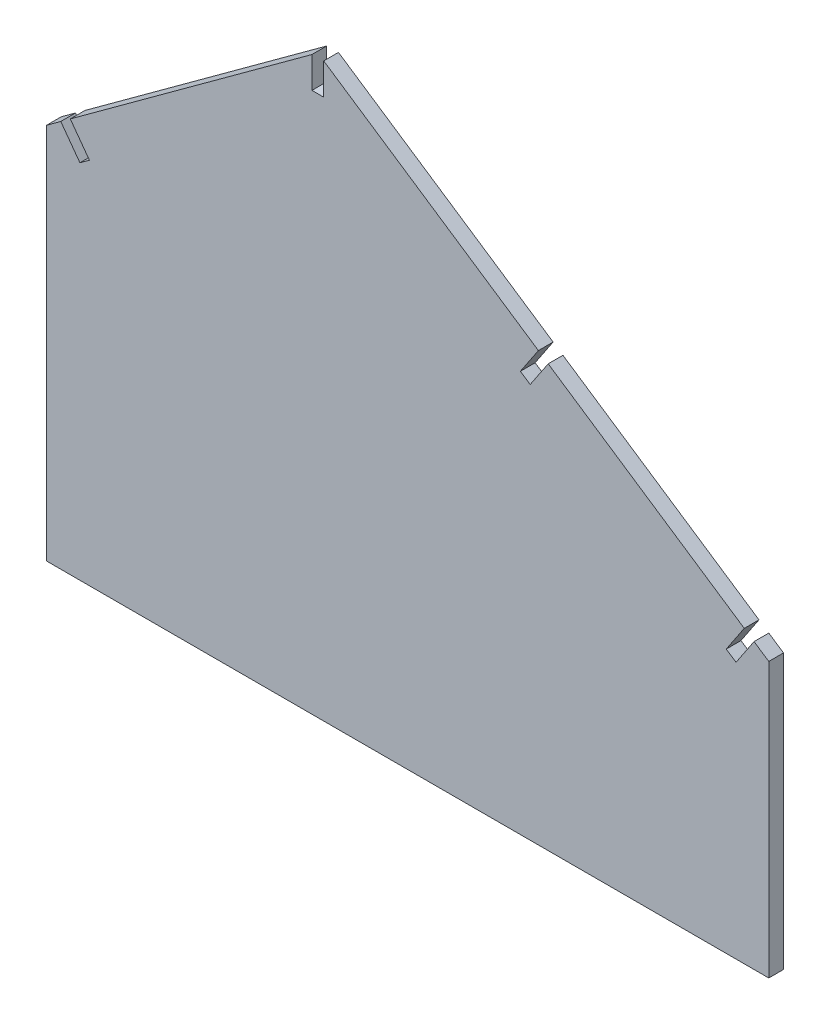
ISO-10303-21;
HEADER;
FILE_DESCRIPTION(('STEP AP214'),'2;1');
FILE_NAME('part.step','',(''),(''),'','','');
FILE_SCHEMA(('AUTOMOTIVE_DESIGN { 1 0 10303 214 1 1 1 1 }'));
ENDSEC;
DATA;
#1=APPLICATION_CONTEXT('core data for automotive mechanical design processes');
#2=APPLICATION_PROTOCOL_DEFINITION('international standard','automotive_design',2000,#1);
#3=PRODUCT_CONTEXT('',#1,'mechanical');
#4=PRODUCT('Part','Part','',(#3));
#5=PRODUCT_RELATED_PRODUCT_CATEGORY('part','',(#4));
#6=PRODUCT_DEFINITION_FORMATION('','',#4);
#7=PRODUCT_DEFINITION_CONTEXT('part definition',#1,'design');
#8=PRODUCT_DEFINITION('design','',#6,#7);
#9=PRODUCT_DEFINITION_SHAPE('','',#8);
#10=(LENGTH_UNIT() NAMED_UNIT(*) SI_UNIT(.MILLI.,.METRE.));
#11=(NAMED_UNIT(*) PLANE_ANGLE_UNIT() SI_UNIT($,.RADIAN.));
#12=(NAMED_UNIT(*) SI_UNIT($,.STERADIAN.) SOLID_ANGLE_UNIT());
#13=UNCERTAINTY_MEASURE_WITH_UNIT(LENGTH_MEASURE(1.E-05),#10,'distance_accuracy_value','');
#14=(GEOMETRIC_REPRESENTATION_CONTEXT(3) GLOBAL_UNCERTAINTY_ASSIGNED_CONTEXT((#13)) GLOBAL_UNIT_ASSIGNED_CONTEXT((#10,
#11,#12)) REPRESENTATION_CONTEXT('',''));
#15=CARTESIAN_POINT('',(0.,0.,0.));
#16=DIRECTION('',(0.,0.,1.));
#17=DIRECTION('',(1.,0.,0.));
#18=AXIS2_PLACEMENT_3D('',#15,#16,#17);
#19=CARTESIAN_POINT('',(-92.0382591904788,55.1138178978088,5.));
#20=DIRECTION('',(1.,0.,0.));
#21=DIRECTION('',(0.,1.,0.));
#22=AXIS2_PLACEMENT_3D('',#19,#20,#21);
#23=PLANE('',#22);
#24=DIRECTION('',(0.,-1.,0.));
#25=VECTOR('',#24,1.);
#26=CARTESIAN_POINT('',(-92.0382591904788,55.1138178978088,0.));
#27=LINE('',#26,#25);
#28=CARTESIAN_POINT('',(-92.0382591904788,55.1138178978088,0.));
#29=VERTEX_POINT('',#28);
#30=CARTESIAN_POINT('',(-92.0382591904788,-72.8861821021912,0.));
#31=VERTEX_POINT('',#30);
#32=EDGE_CURVE('E166',#29,#31,#27,.T.);
#33=ORIENTED_EDGE('',*,*,#32,.T.);
#34=DIRECTION('',(0.,0.,-1.));
#35=VECTOR('',#34,1.);
#36=CARTESIAN_POINT('',(-92.0382591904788,-72.8861821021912,5.));
#37=LINE('',#36,#35);
#38=CARTESIAN_POINT('',(-92.0382591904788,-72.8861821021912,5.));
#39=VERTEX_POINT('',#38);
#40=EDGE_CURVE('E11',#39,#31,#37,.T.);
#41=ORIENTED_EDGE('',*,*,#40,.F.);
#42=DIRECTION('',(0.,-1.,0.));
#43=VECTOR('',#42,1.);
#44=CARTESIAN_POINT('',(-92.0382591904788,55.1138178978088,5.));
#45=LINE('',#44,#43);
#46=CARTESIAN_POINT('',(-92.0382591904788,55.1138178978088,5.));
#47=VERTEX_POINT('',#46);
#48=EDGE_CURVE('E217',#47,#39,#45,.T.);
#49=ORIENTED_EDGE('',*,*,#48,.F.);
#50=DIRECTION('',(0.,0.,-1.));
#51=VECTOR('',#50,1.);
#52=CARTESIAN_POINT('',(-92.0382591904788,55.1138178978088,5.));
#53=LINE('',#52,#51);
#54=EDGE_CURVE('E179',#47,#29,#53,.T.);
#55=ORIENTED_EDGE('',*,*,#54,.T.);
#56=EDGE_LOOP('',(#33,#41,#49,#55));
#57=FACE_BOUND('',#56,.T.);
#58=ADVANCED_FACE('F26',(#57),#23,.F.);
#59=CARTESIAN_POINT('',(-92.0382591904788,-72.8861821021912,5.));
#60=DIRECTION('',(0.,1.,0.));
#61=DIRECTION('',(-1.,0.,0.));
#62=AXIS2_PLACEMENT_3D('',#59,#60,#61);
#63=PLANE('',#62);
#64=DIRECTION('',(1.,0.,0.));
#65=VECTOR('',#64,1.);
#66=CARTESIAN_POINT('',(-92.0382591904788,-72.8861821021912,0.));
#67=LINE('',#66,#65);
#68=CARTESIAN_POINT('',(152.961740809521,-72.8861821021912,0.));
#69=VERTEX_POINT('',#68);
#70=EDGE_CURVE('E162',#31,#69,#67,.T.);
#71=ORIENTED_EDGE('',*,*,#70,.T.);
#72=DIRECTION('',(0.,0.,-1.));
#73=VECTOR('',#72,1.);
#74=CARTESIAN_POINT('',(152.961740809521,-72.8861821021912,5.));
#75=LINE('',#74,#73);
#76=CARTESIAN_POINT('',(152.961740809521,-72.8861821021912,5.));
#77=VERTEX_POINT('',#76);
#78=EDGE_CURVE('E33',#77,#69,#75,.T.);
#79=ORIENTED_EDGE('',*,*,#78,.F.);
#80=DIRECTION('',(1.,0.,0.));
#81=VECTOR('',#80,1.);
#82=CARTESIAN_POINT('',(-92.0382591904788,-72.8861821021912,5.));
#83=LINE('',#82,#81);
#84=EDGE_CURVE('E175',#39,#77,#83,.T.);
#85=ORIENTED_EDGE('',*,*,#84,.F.);
#86=ORIENTED_EDGE('',*,*,#40,.T.);
#87=EDGE_LOOP('',(#71,#79,#85,#86));
#88=FACE_BOUND('',#87,.T.);
#89=ADVANCED_FACE('F174',(#88),#63,.F.);
#90=CARTESIAN_POINT('',(152.961740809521,-72.8861821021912,5.));
#91=DIRECTION('',(-1.,0.,0.));
#92=DIRECTION('',(0.,0.,1.));
#93=AXIS2_PLACEMENT_3D('',#90,#91,#92);
#94=PLANE('',#93);
#95=DIRECTION('',(0.,1.,0.));
#96=VECTOR('',#95,1.);
#97=CARTESIAN_POINT('',(152.961740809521,-72.8861821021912,0.));
#98=LINE('',#97,#96);
#99=CARTESIAN_POINT('',(152.961740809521,20.1138178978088,0.));
#100=VERTEX_POINT('',#99);
#101=EDGE_CURVE('E168',#69,#100,#98,.T.);
#102=ORIENTED_EDGE('',*,*,#101,.T.);
#103=DIRECTION('',(0.,0.,-1.));
#104=VECTOR('',#103,1.);
#105=CARTESIAN_POINT('',(152.961740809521,20.1138178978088,5.));
#106=LINE('',#105,#104);
#107=CARTESIAN_POINT('',(152.961740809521,20.1138178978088,5.));
#108=VERTEX_POINT('',#107);
#109=EDGE_CURVE('E303',#108,#100,#106,.T.);
#110=ORIENTED_EDGE('',*,*,#109,.F.);
#111=DIRECTION('',(0.,1.,0.));
#112=VECTOR('',#111,1.);
#113=CARTESIAN_POINT('',(152.961740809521,-72.8861821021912,5.));
#114=LINE('',#113,#112);
#115=EDGE_CURVE('E220',#77,#108,#114,.T.);
#116=ORIENTED_EDGE('',*,*,#115,.F.);
#117=ORIENTED_EDGE('',*,*,#78,.T.);
#118=EDGE_LOOP('',(#102,#110,#116,#117));
#119=FACE_BOUND('',#118,.T.);
#120=ADVANCED_FACE('F307',(#119),#94,.F.);
#121=CARTESIAN_POINT('',(152.961740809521,20.1138178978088,5.));
#122=DIRECTION('',(-0.555803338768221,-0.831313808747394,0.));
#123=DIRECTION('',(0.831313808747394,-0.555803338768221,0.));
#124=AXIS2_PLACEMENT_3D('',#121,#122,#123);
#125=PLANE('',#124);
#126=DIRECTION('',(-0.831313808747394,0.555803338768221,0.));
#127=VECTOR('',#126,1.);
#128=CARTESIAN_POINT('',(152.961740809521,20.1138178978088,0.));
#129=LINE('',#128,#127);
#130=CARTESIAN_POINT('',(147.973857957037,23.4486379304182,0.));
#131=VERTEX_POINT('',#130);
#132=EDGE_CURVE('E183',#100,#131,#129,.T.);
#133=ORIENTED_EDGE('',*,*,#132,.T.);
#134=DIRECTION('',(0.,0.,-1.));
#135=VECTOR('',#134,1.);
#136=CARTESIAN_POINT('',(147.973857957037,23.4486379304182,5.));
#137=LINE('',#136,#135);
#138=CARTESIAN_POINT('',(147.973857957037,23.4486379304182,5.));
#139=VERTEX_POINT('',#138);
#140=EDGE_CURVE('E300',#139,#131,#137,.T.);
#141=ORIENTED_EDGE('',*,*,#140,.F.);
#142=DIRECTION('',(-0.831313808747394,0.555803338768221,0.));
#143=VECTOR('',#142,1.);
#144=CARTESIAN_POINT('',(152.961740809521,20.1138178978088,5.));
#145=LINE('',#144,#143);
#146=EDGE_CURVE('E222',#108,#139,#145,.T.);
#147=ORIENTED_EDGE('',*,*,#146,.F.);
#148=ORIENTED_EDGE('',*,*,#109,.T.);
#149=EDGE_LOOP('',(#133,#141,#147,#148));
#150=FACE_BOUND('',#149,.T.);
#151=ADVANCED_FACE('F315',(#150),#125,.F.);
#152=CARTESIAN_POINT('',(147.973857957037,23.4486379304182,5.));
#153=DIRECTION('',(0.831313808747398,-0.555803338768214,0.));
#154=DIRECTION('',(0.555803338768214,0.831313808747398,0.));
#155=AXIS2_PLACEMENT_3D('',#152,#153,#154);
#156=PLANE('',#155);
#157=DIRECTION('',(-0.555803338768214,-0.831313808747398,0.));
#158=VECTOR('',#157,1.);
#159=CARTESIAN_POINT('',(147.973857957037,23.4486379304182,0.));
#160=LINE('',#159,#158);
#161=CARTESIAN_POINT('',(141.860021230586,14.3041860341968,0.));
#162=VERTEX_POINT('',#161);
#163=EDGE_CURVE('E185',#131,#162,#160,.T.);
#164=ORIENTED_EDGE('',*,*,#163,.T.);
#165=DIRECTION('',(0.,0.,-1.));
#166=VECTOR('',#165,1.);
#167=CARTESIAN_POINT('',(141.860021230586,14.3041860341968,5.));
#168=LINE('',#167,#166);
#169=CARTESIAN_POINT('',(141.860021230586,14.3041860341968,5.));
#170=VERTEX_POINT('',#169);
#171=EDGE_CURVE('E297',#170,#162,#168,.T.);
#172=ORIENTED_EDGE('',*,*,#171,.F.);
#173=DIRECTION('',(-0.555803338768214,-0.831313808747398,0.));
#174=VECTOR('',#173,1.);
#175=CARTESIAN_POINT('',(147.973857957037,23.4486379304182,5.));
#176=LINE('',#175,#174);
#177=EDGE_CURVE('E224',#139,#170,#176,.T.);
#178=ORIENTED_EDGE('',*,*,#177,.F.);
#179=ORIENTED_EDGE('',*,*,#140,.T.);
#180=EDGE_LOOP('',(#164,#172,#178,#179));
#181=FACE_BOUND('',#180,.T.);
#182=ADVANCED_FACE('F318',(#181),#156,.F.);
#183=CARTESIAN_POINT('',(138.534765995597,16.5273993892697,5.));
#184=DIRECTION('',(-0.555803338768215,-0.831313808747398,0.));
#185=DIRECTION('',(0.831313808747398,-0.555803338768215,0.));
#186=AXIS2_PLACEMENT_3D('',#183,#184,#185);
#187=PLANE('',#186);
#188=DIRECTION('',(-0.831313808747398,0.555803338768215,0.));
#189=VECTOR('',#188,1.);
#190=CARTESIAN_POINT('',(138.534765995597,16.5273993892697,0.));
#191=LINE('',#190,#189);
#192=CARTESIAN_POINT('',(138.534765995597,16.5273993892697,0.));
#193=VERTEX_POINT('',#192);
#194=EDGE_CURVE('E187',#162,#193,#191,.T.);
#195=ORIENTED_EDGE('',*,*,#194,.T.);
#196=DIRECTION('',(0.,0.,-1.));
#197=VECTOR('',#196,1.);
#198=CARTESIAN_POINT('',(138.534765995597,16.5273993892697,5.));
#199=LINE('',#198,#197);
#200=CARTESIAN_POINT('',(138.534765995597,16.5273993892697,5.));
#201=VERTEX_POINT('',#200);
#202=EDGE_CURVE('E294',#201,#193,#199,.T.);
#203=ORIENTED_EDGE('',*,*,#202,.F.);
#204=DIRECTION('',(-0.831313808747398,0.555803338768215,0.));
#205=VECTOR('',#204,1.);
#206=CARTESIAN_POINT('',(138.534765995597,16.5273993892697,5.));
#207=LINE('',#206,#205);
#208=EDGE_CURVE('E226',#170,#201,#207,.T.);
#209=ORIENTED_EDGE('',*,*,#208,.F.);
#210=ORIENTED_EDGE('',*,*,#171,.T.);
#211=EDGE_LOOP('',(#195,#203,#209,#210));
#212=FACE_BOUND('',#211,.T.);
#213=ADVANCED_FACE('F323',(#212),#187,.F.);
#214=CARTESIAN_POINT('',(138.534765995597,16.5273993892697,5.));
#215=DIRECTION('',(-0.831313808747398,0.555803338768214,0.));
#216=DIRECTION('',(-0.555803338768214,-0.831313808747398,0.));
#217=AXIS2_PLACEMENT_3D('',#214,#215,#216);
#218=PLANE('',#217);
#219=DIRECTION('',(0.555803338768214,0.831313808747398,0.));
#220=VECTOR('',#219,1.);
#221=CARTESIAN_POINT('',(138.534765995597,16.5273993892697,0.));
#222=LINE('',#221,#220);
#223=CARTESIAN_POINT('',(144.648602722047,25.671851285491,0.));
#224=VERTEX_POINT('',#223);
#225=EDGE_CURVE('E189',#193,#224,#222,.T.);
#226=ORIENTED_EDGE('',*,*,#225,.T.);
#227=DIRECTION('',(0.,0.,-1.));
#228=VECTOR('',#227,1.);
#229=CARTESIAN_POINT('',(144.648602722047,25.671851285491,5.));
#230=LINE('',#229,#228);
#231=CARTESIAN_POINT('',(144.648602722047,25.671851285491,5.));
#232=VERTEX_POINT('',#231);
#233=EDGE_CURVE('E291',#232,#224,#230,.T.);
#234=ORIENTED_EDGE('',*,*,#233,.F.);
#235=DIRECTION('',(0.555803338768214,0.831313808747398,0.));
#236=VECTOR('',#235,1.);
#237=CARTESIAN_POINT('',(138.534765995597,16.5273993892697,5.));
#238=LINE('',#237,#236);
#239=EDGE_CURVE('E228',#201,#232,#238,.T.);
#240=ORIENTED_EDGE('',*,*,#239,.F.);
#241=ORIENTED_EDGE('',*,*,#202,.T.);
#242=EDGE_LOOP('',(#226,#234,#240,#241));
#243=FACE_BOUND('',#242,.T.);
#244=ADVANCED_FACE('F329',(#243),#218,.F.);
#245=CARTESIAN_POINT('',(144.648602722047,25.671851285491,5.));
#246=DIRECTION('',(-0.555803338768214,-0.831313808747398,0.));
#247=DIRECTION('',(0.831313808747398,-0.555803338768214,0.));
#248=AXIS2_PLACEMENT_3D('',#245,#246,#247);
#249=PLANE('',#248);
#250=DIRECTION('',(-0.831313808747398,0.555803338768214,0.));
#251=VECTOR('',#250,1.);
#252=CARTESIAN_POINT('',(144.648602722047,25.671851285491,0.));
#253=LINE('',#252,#251);
#254=CARTESIAN_POINT('',(78.1434980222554,70.1361183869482,0.));
#255=VERTEX_POINT('',#254);
#256=EDGE_CURVE('E191',#224,#255,#253,.T.);
#257=ORIENTED_EDGE('',*,*,#256,.T.);
#258=DIRECTION('',(0.,0.,-1.));
#259=VECTOR('',#258,1.);
#260=CARTESIAN_POINT('',(78.1434980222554,70.1361183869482,5.));
#261=LINE('',#260,#259);
#262=CARTESIAN_POINT('',(78.1434980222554,70.1361183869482,5.));
#263=VERTEX_POINT('',#262);
#264=EDGE_CURVE('E288',#263,#255,#261,.T.);
#265=ORIENTED_EDGE('',*,*,#264,.F.);
#266=DIRECTION('',(-0.831313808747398,0.555803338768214,0.));
#267=VECTOR('',#266,1.);
#268=CARTESIAN_POINT('',(144.648602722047,25.671851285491,5.));
#269=LINE('',#268,#267);
#270=EDGE_CURVE('E230',#232,#263,#269,.T.);
#271=ORIENTED_EDGE('',*,*,#270,.F.);
#272=ORIENTED_EDGE('',*,*,#233,.T.);
#273=EDGE_LOOP('',(#257,#265,#271,#272));
#274=FACE_BOUND('',#273,.T.);
#275=ADVANCED_FACE('F333',(#274),#249,.F.);
#276=CARTESIAN_POINT('',(78.1434980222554,70.1361183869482,5.));
#277=DIRECTION('',(0.831313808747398,-0.555803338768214,0.));
#278=DIRECTION('',(0.555803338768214,0.831313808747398,0.));
#279=AXIS2_PLACEMENT_3D('',#276,#277,#278);
#280=PLANE('',#279);
#281=DIRECTION('',(-0.555803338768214,-0.831313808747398,0.));
#282=VECTOR('',#281,1.);
#283=CARTESIAN_POINT('',(78.1434980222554,70.1361183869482,0.));
#284=LINE('',#283,#282);
#285=CARTESIAN_POINT('',(72.0296612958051,60.9916664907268,0.));
#286=VERTEX_POINT('',#285);
#287=EDGE_CURVE('E193',#255,#286,#284,.T.);
#288=ORIENTED_EDGE('',*,*,#287,.T.);
#289=DIRECTION('',(0.,0.,-1.));
#290=VECTOR('',#289,1.);
#291=CARTESIAN_POINT('',(72.0296612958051,60.9916664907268,5.));
#292=LINE('',#291,#290);
#293=CARTESIAN_POINT('',(72.0296612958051,60.9916664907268,5.));
#294=VERTEX_POINT('',#293);
#295=EDGE_CURVE('E285',#294,#286,#292,.T.);
#296=ORIENTED_EDGE('',*,*,#295,.F.);
#297=DIRECTION('',(-0.555803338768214,-0.831313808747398,0.));
#298=VECTOR('',#297,1.);
#299=CARTESIAN_POINT('',(78.1434980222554,70.1361183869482,5.));
#300=LINE('',#299,#298);
#301=EDGE_CURVE('E232',#263,#294,#300,.T.);
#302=ORIENTED_EDGE('',*,*,#301,.F.);
#303=ORIENTED_EDGE('',*,*,#264,.T.);
#304=EDGE_LOOP('',(#288,#296,#302,#303));
#305=FACE_BOUND('',#304,.T.);
#306=ADVANCED_FACE('F338',(#305),#280,.F.);
#307=CARTESIAN_POINT('',(68.7044060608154,63.2148798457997,5.));
#308=DIRECTION('',(-0.555803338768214,-0.831313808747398,0.));
#309=DIRECTION('',(0.831313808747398,-0.555803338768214,0.));
#310=AXIS2_PLACEMENT_3D('',#307,#308,#309);
#311=PLANE('',#310);
#312=DIRECTION('',(-0.831313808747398,0.555803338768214,0.));
#313=VECTOR('',#312,1.);
#314=CARTESIAN_POINT('',(68.7044060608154,63.2148798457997,0.));
#315=LINE('',#314,#313);
#316=CARTESIAN_POINT('',(68.7044060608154,63.2148798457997,0.));
#317=VERTEX_POINT('',#316);
#318=EDGE_CURVE('E195',#286,#317,#315,.T.);
#319=ORIENTED_EDGE('',*,*,#318,.T.);
#320=DIRECTION('',(0.,0.,-1.));
#321=VECTOR('',#320,1.);
#322=CARTESIAN_POINT('',(68.7044060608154,63.2148798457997,5.));
#323=LINE('',#322,#321);
#324=CARTESIAN_POINT('',(68.7044060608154,63.2148798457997,5.));
#325=VERTEX_POINT('',#324);
#326=EDGE_CURVE('E282',#325,#317,#323,.T.);
#327=ORIENTED_EDGE('',*,*,#326,.F.);
#328=DIRECTION('',(-0.831313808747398,0.555803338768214,0.));
#329=VECTOR('',#328,1.);
#330=CARTESIAN_POINT('',(68.7044060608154,63.2148798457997,5.));
#331=LINE('',#330,#329);
#332=EDGE_CURVE('E234',#294,#325,#331,.T.);
#333=ORIENTED_EDGE('',*,*,#332,.F.);
#334=ORIENTED_EDGE('',*,*,#295,.T.);
#335=EDGE_LOOP('',(#319,#327,#333,#334));
#336=FACE_BOUND('',#335,.T.);
#337=ADVANCED_FACE('F344',(#336),#311,.F.);
#338=CARTESIAN_POINT('',(68.7044060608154,63.2148798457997,5.));
#339=DIRECTION('',(-0.831313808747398,0.555803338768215,0.));
#340=DIRECTION('',(-0.555803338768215,-0.831313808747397,0.));
#341=AXIS2_PLACEMENT_3D('',#338,#339,#340);
#342=PLANE('',#341);
#343=DIRECTION('',(0.555803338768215,0.831313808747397,0.));
#344=VECTOR('',#343,1.);
#345=CARTESIAN_POINT('',(68.7044060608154,63.2148798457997,0.));
#346=LINE('',#345,#344);
#347=CARTESIAN_POINT('',(74.8182427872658,72.359331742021,0.));
#348=VERTEX_POINT('',#347);
#349=EDGE_CURVE('E197',#317,#348,#346,.T.);
#350=ORIENTED_EDGE('',*,*,#349,.T.);
#351=DIRECTION('',(0.,0.,-1.));
#352=VECTOR('',#351,1.);
#353=CARTESIAN_POINT('',(74.8182427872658,72.359331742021,5.));
#354=LINE('',#353,#352);
#355=CARTESIAN_POINT('',(74.8182427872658,72.359331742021,5.));
#356=VERTEX_POINT('',#355);
#357=EDGE_CURVE('E279',#356,#348,#354,.T.);
#358=ORIENTED_EDGE('',*,*,#357,.F.);
#359=DIRECTION('',(0.555803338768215,0.831313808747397,0.));
#360=VECTOR('',#359,1.);
#361=CARTESIAN_POINT('',(68.7044060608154,63.2148798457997,5.));
#362=LINE('',#361,#360);
#363=EDGE_CURVE('E236',#325,#356,#362,.T.);
#364=ORIENTED_EDGE('',*,*,#363,.F.);
#365=ORIENTED_EDGE('',*,*,#326,.T.);
#366=EDGE_LOOP('',(#350,#358,#364,#365));
#367=FACE_BOUND('',#366,.T.);
#368=ADVANCED_FACE('F348',(#367),#342,.F.);
#369=CARTESIAN_POINT('',(74.8182427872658,72.359331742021,5.));
#370=DIRECTION('',(-0.555803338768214,-0.831313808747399,0.));
#371=DIRECTION('',(0.831313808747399,-0.555803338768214,0.));
#372=AXIS2_PLACEMENT_3D('',#369,#370,#371);
#373=PLANE('',#372);
#374=DIRECTION('',(-0.831313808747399,0.555803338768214,0.));
#375=VECTOR('',#374,1.);
#376=CARTESIAN_POINT('',(74.8182427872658,72.359331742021,0.));
#377=LINE('',#376,#375);
#378=CARTESIAN_POINT('',(2.,121.04446368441,0.));
#379=VERTEX_POINT('',#378);
#380=EDGE_CURVE('E199',#348,#379,#377,.T.);
#381=ORIENTED_EDGE('',*,*,#380,.T.);
#382=DIRECTION('',(0.,0.,-1.));
#383=VECTOR('',#382,1.);
#384=CARTESIAN_POINT('',(2.,121.04446368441,5.));
#385=LINE('',#384,#383);
#386=CARTESIAN_POINT('',(2.,121.04446368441,5.));
#387=VERTEX_POINT('',#386);
#388=EDGE_CURVE('E276',#387,#379,#385,.T.);
#389=ORIENTED_EDGE('',*,*,#388,.F.);
#390=DIRECTION('',(-0.831313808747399,0.555803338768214,0.));
#391=VECTOR('',#390,1.);
#392=CARTESIAN_POINT('',(74.8182427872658,72.359331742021,5.));
#393=LINE('',#392,#391);
#394=EDGE_CURVE('E238',#356,#387,#393,.T.);
#395=ORIENTED_EDGE('',*,*,#394,.F.);
#396=ORIENTED_EDGE('',*,*,#357,.T.);
#397=EDGE_LOOP('',(#381,#389,#395,#396));
#398=FACE_BOUND('',#397,.T.);
#399=ADVANCED_FACE('F353',(#398),#373,.F.);
#400=CARTESIAN_POINT('',(1.99999999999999,110.38163223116,5.));
#401=DIRECTION('',(1.,0.,0.));
#402=DIRECTION('',(0.,1.,0.));
#403=AXIS2_PLACEMENT_3D('',#400,#401,#402);
#404=PLANE('',#403);
#405=DIRECTION('',(0.,-1.,0.));
#406=VECTOR('',#405,1.);
#407=CARTESIAN_POINT('',(1.99999999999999,110.38163223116,0.));
#408=LINE('',#407,#406);
#409=CARTESIAN_POINT('',(1.99999999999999,110.38163223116,0.));
#410=VERTEX_POINT('',#409);
#411=EDGE_CURVE('E201',#379,#410,#408,.T.);
#412=ORIENTED_EDGE('',*,*,#411,.T.);
#413=DIRECTION('',(0.,0.,-1.));
#414=VECTOR('',#413,1.);
#415=CARTESIAN_POINT('',(1.99999999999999,110.38163223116,5.));
#416=LINE('',#415,#414);
#417=CARTESIAN_POINT('',(1.99999999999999,110.38163223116,5.));
#418=VERTEX_POINT('',#417);
#419=EDGE_CURVE('E273',#418,#410,#416,.T.);
#420=ORIENTED_EDGE('',*,*,#419,.F.);
#421=DIRECTION('',(0.,-1.,0.));
#422=VECTOR('',#421,1.);
#423=CARTESIAN_POINT('',(1.99999999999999,110.38163223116,5.));
#424=LINE('',#423,#422);
#425=EDGE_CURVE('E240',#387,#418,#424,.T.);
#426=ORIENTED_EDGE('',*,*,#425,.F.);
#427=ORIENTED_EDGE('',*,*,#388,.T.);
#428=EDGE_LOOP('',(#412,#420,#426,#427));
#429=FACE_BOUND('',#428,.T.);
#430=ADVANCED_FACE('F359',(#429),#404,.F.);
#431=CARTESIAN_POINT('',(-2.00000000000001,110.38163223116,5.));
#432=DIRECTION('',(0.,-1.,0.));
#433=DIRECTION('',(0.,0.,-1.));
#434=AXIS2_PLACEMENT_3D('',#431,#432,#433);
#435=PLANE('',#434);
#436=DIRECTION('',(-1.,0.,0.));
#437=VECTOR('',#436,1.);
#438=CARTESIAN_POINT('',(-2.00000000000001,110.38163223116,0.));
#439=LINE('',#438,#437);
#440=CARTESIAN_POINT('',(-2.00000000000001,110.38163223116,0.));
#441=VERTEX_POINT('',#440);
#442=EDGE_CURVE('E203',#410,#441,#439,.T.);
#443=ORIENTED_EDGE('',*,*,#442,.T.);
#444=DIRECTION('',(0.,0.,-1.));
#445=VECTOR('',#444,1.);
#446=CARTESIAN_POINT('',(-2.00000000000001,110.38163223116,5.));
#447=LINE('',#446,#445);
#448=CARTESIAN_POINT('',(-2.00000000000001,110.38163223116,5.));
#449=VERTEX_POINT('',#448);
#450=EDGE_CURVE('E270',#449,#441,#447,.T.);
#451=ORIENTED_EDGE('',*,*,#450,.F.);
#452=DIRECTION('',(-1.,0.,0.));
#453=VECTOR('',#452,1.);
#454=CARTESIAN_POINT('',(-2.00000000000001,110.38163223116,5.));
#455=LINE('',#454,#453);
#456=EDGE_CURVE('E242',#418,#449,#455,.T.);
#457=ORIENTED_EDGE('',*,*,#456,.F.);
#458=ORIENTED_EDGE('',*,*,#419,.T.);
#459=EDGE_LOOP('',(#443,#451,#457,#458));
#460=FACE_BOUND('',#459,.T.);
#461=ADVANCED_FACE('F363',(#460),#435,.F.);
#462=CARTESIAN_POINT('',(-2.00000000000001,120.919896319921,5.));
#463=DIRECTION('',(-1.,0.,0.));
#464=DIRECTION('',(0.,-1.,0.));
#465=AXIS2_PLACEMENT_3D('',#462,#463,#464);
#466=PLANE('',#465);
#467=DIRECTION('',(0.,1.,0.));
#468=VECTOR('',#467,1.);
#469=CARTESIAN_POINT('',(-2.00000000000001,120.919896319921,0.));
#470=LINE('',#469,#468);
#471=CARTESIAN_POINT('',(-2.00000000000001,120.919896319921,0.));
#472=VERTEX_POINT('',#471);
#473=EDGE_CURVE('E205',#441,#472,#470,.T.);
#474=ORIENTED_EDGE('',*,*,#473,.T.);
#475=DIRECTION('',(0.,0.,-1.));
#476=VECTOR('',#475,1.);
#477=CARTESIAN_POINT('',(-2.00000000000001,120.919896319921,5.));
#478=LINE('',#477,#476);
#479=CARTESIAN_POINT('',(-2.00000000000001,120.919896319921,5.));
#480=VERTEX_POINT('',#479);
#481=EDGE_CURVE('E267',#480,#472,#478,.T.);
#482=ORIENTED_EDGE('',*,*,#481,.F.);
#483=DIRECTION('',(0.,1.,0.));
#484=VECTOR('',#483,1.);
#485=CARTESIAN_POINT('',(-2.00000000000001,120.919896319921,5.));
#486=LINE('',#485,#484);
#487=EDGE_CURVE('E244',#449,#480,#486,.T.);
#488=ORIENTED_EDGE('',*,*,#487,.F.);
#489=ORIENTED_EDGE('',*,*,#450,.T.);
#490=EDGE_LOOP('',(#474,#482,#488,#489));
#491=FACE_BOUND('',#490,.T.);
#492=ADVANCED_FACE('F368',(#491),#466,.F.);
#493=CARTESIAN_POINT('',(-2.00000000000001,120.919896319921,5.));
#494=DIRECTION('',(0.590068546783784,-0.807353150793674,0.));
#495=DIRECTION('',(0.807353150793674,0.590068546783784,0.));
#496=AXIS2_PLACEMENT_3D('',#493,#494,#495);
#497=PLANE('',#496);
#498=DIRECTION('',(-0.807353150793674,-0.590068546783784,0.));
#499=VECTOR('',#498,1.);
#500=CARTESIAN_POINT('',(-2.00000000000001,120.919896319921,0.));
#501=LINE('',#500,#499);
#502=CARTESIAN_POINT('',(-83.9647276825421,61.0145033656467,0.));
#503=VERTEX_POINT('',#502);
#504=EDGE_CURVE('E207',#472,#503,#501,.T.);
#505=ORIENTED_EDGE('',*,*,#504,.T.);
#506=DIRECTION('',(0.,0.,-1.));
#507=VECTOR('',#506,1.);
#508=CARTESIAN_POINT('',(-83.9647276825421,61.0145033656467,5.));
#509=LINE('',#508,#507);
#510=CARTESIAN_POINT('',(-83.9647276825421,61.0145033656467,5.));
#511=VERTEX_POINT('',#510);
#512=EDGE_CURVE('E264',#511,#503,#509,.T.);
#513=ORIENTED_EDGE('',*,*,#512,.F.);
#514=DIRECTION('',(-0.807353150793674,-0.590068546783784,0.));
#515=VECTOR('',#514,1.);
#516=CARTESIAN_POINT('',(-2.00000000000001,120.919896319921,5.));
#517=LINE('',#516,#515);
#518=EDGE_CURVE('E246',#480,#511,#517,.T.);
#519=ORIENTED_EDGE('',*,*,#518,.F.);
#520=ORIENTED_EDGE('',*,*,#481,.T.);
#521=EDGE_LOOP('',(#505,#513,#519,#520));
#522=FACE_BOUND('',#521,.T.);
#523=ADVANCED_FACE('F374',(#522),#497,.F.);
#524=CARTESIAN_POINT('',(-83.9647276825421,61.0145033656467,5.));
#525=DIRECTION('',(0.807353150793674,0.590068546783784,0.));
#526=DIRECTION('',(-0.590068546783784,0.807353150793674,0.));
#527=AXIS2_PLACEMENT_3D('',#524,#525,#526);
#528=PLANE('',#527);
#529=DIRECTION('',(0.590068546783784,-0.807353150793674,0.));
#530=VECTOR('',#529,1.);
#531=CARTESIAN_POINT('',(-83.9647276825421,61.0145033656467,0.));
#532=LINE('',#531,#530);
#533=CARTESIAN_POINT('',(-77.4739736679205,52.1336187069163,0.));
#534=VERTEX_POINT('',#533);
#535=EDGE_CURVE('E209',#503,#534,#532,.T.);
#536=ORIENTED_EDGE('',*,*,#535,.T.);
#537=DIRECTION('',(0.,0.,-1.));
#538=VECTOR('',#537,1.);
#539=CARTESIAN_POINT('',(-77.4739736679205,52.1336187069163,5.));
#540=LINE('',#539,#538);
#541=CARTESIAN_POINT('',(-77.4739736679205,52.1336187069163,5.));
#542=VERTEX_POINT('',#541);
#543=EDGE_CURVE('E261',#542,#534,#540,.T.);
#544=ORIENTED_EDGE('',*,*,#543,.F.);
#545=DIRECTION('',(0.590068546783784,-0.807353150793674,0.));
#546=VECTOR('',#545,1.);
#547=CARTESIAN_POINT('',(-83.9647276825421,61.0145033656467,5.));
#548=LINE('',#547,#546);
#549=EDGE_CURVE('E248',#511,#542,#548,.T.);
#550=ORIENTED_EDGE('',*,*,#549,.F.);
#551=ORIENTED_EDGE('',*,*,#512,.T.);
#552=EDGE_LOOP('',(#536,#544,#550,#551));
#553=FACE_BOUND('',#552,.T.);
#554=ADVANCED_FACE('F378',(#553),#528,.F.);
#555=CARTESIAN_POINT('',(-80.7033862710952,49.7733445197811,5.));
#556=DIRECTION('',(0.590068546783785,-0.807353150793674,0.));
#557=DIRECTION('',(0.807353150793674,0.590068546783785,0.));
#558=AXIS2_PLACEMENT_3D('',#555,#556,#557);
#559=PLANE('',#558);
#560=DIRECTION('',(-0.807353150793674,-0.590068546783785,0.));
#561=VECTOR('',#560,1.);
#562=CARTESIAN_POINT('',(-80.7033862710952,49.7733445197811,0.));
#563=LINE('',#562,#561);
#564=CARTESIAN_POINT('',(-80.7033862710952,49.7733445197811,0.));
#565=VERTEX_POINT('',#564);
#566=EDGE_CURVE('E211',#534,#565,#563,.T.);
#567=ORIENTED_EDGE('',*,*,#566,.T.);
#568=DIRECTION('',(0.,0.,-1.));
#569=VECTOR('',#568,1.);
#570=CARTESIAN_POINT('',(-80.7033862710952,49.7733445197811,5.));
#571=LINE('',#570,#569);
#572=CARTESIAN_POINT('',(-80.7033862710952,49.7733445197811,5.));
#573=VERTEX_POINT('',#572);
#574=EDGE_CURVE('E258',#573,#565,#571,.T.);
#575=ORIENTED_EDGE('',*,*,#574,.F.);
#576=DIRECTION('',(-0.807353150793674,-0.590068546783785,0.));
#577=VECTOR('',#576,1.);
#578=CARTESIAN_POINT('',(-80.7033862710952,49.7733445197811,5.));
#579=LINE('',#578,#577);
#580=EDGE_CURVE('E250',#542,#573,#579,.T.);
#581=ORIENTED_EDGE('',*,*,#580,.F.);
#582=ORIENTED_EDGE('',*,*,#543,.T.);
#583=EDGE_LOOP('',(#567,#575,#581,#582));
#584=FACE_BOUND('',#583,.T.);
#585=ADVANCED_FACE('F383',(#584),#559,.F.);
#586=CARTESIAN_POINT('',(-80.7033862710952,49.7733445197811,5.));
#587=DIRECTION('',(-0.807353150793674,-0.590068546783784,0.));
#588=DIRECTION('',(0.590068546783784,-0.807353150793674,0.));
#589=AXIS2_PLACEMENT_3D('',#586,#587,#588);
#590=PLANE('',#589);
#591=DIRECTION('',(-0.590068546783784,0.807353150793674,0.));
#592=VECTOR('',#591,1.);
#593=CARTESIAN_POINT('',(-80.7033862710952,49.7733445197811,0.));
#594=LINE('',#593,#592);
#595=CARTESIAN_POINT('',(-87.1941402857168,58.6542291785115,0.));
#596=VERTEX_POINT('',#595);
#597=EDGE_CURVE('E213',#565,#596,#594,.T.);
#598=ORIENTED_EDGE('',*,*,#597,.T.);
#599=DIRECTION('',(0.,0.,-1.));
#600=VECTOR('',#599,1.);
#601=CARTESIAN_POINT('',(-87.1941402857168,58.6542291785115,5.));
#602=LINE('',#601,#600);
#603=CARTESIAN_POINT('',(-87.1941402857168,58.6542291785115,5.));
#604=VERTEX_POINT('',#603);
#605=EDGE_CURVE('E255',#604,#596,#602,.T.);
#606=ORIENTED_EDGE('',*,*,#605,.F.);
#607=DIRECTION('',(-0.590068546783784,0.807353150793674,0.));
#608=VECTOR('',#607,1.);
#609=CARTESIAN_POINT('',(-80.7033862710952,49.7733445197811,5.));
#610=LINE('',#609,#608);
#611=EDGE_CURVE('E45',#573,#604,#610,.T.);
#612=ORIENTED_EDGE('',*,*,#611,.F.);
#613=ORIENTED_EDGE('',*,*,#574,.T.);
#614=EDGE_LOOP('',(#598,#606,#612,#613));
#615=FACE_BOUND('',#614,.T.);
#616=ADVANCED_FACE('F386',(#615),#590,.F.);
#617=CARTESIAN_POINT('',(-87.1941402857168,58.6542291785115,5.));
#618=DIRECTION('',(0.590068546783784,-0.807353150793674,0.));
#619=DIRECTION('',(0.807353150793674,0.590068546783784,0.));
#620=AXIS2_PLACEMENT_3D('',#617,#618,#619);
#621=PLANE('',#620);
#622=DIRECTION('',(-0.807353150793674,-0.590068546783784,0.));
#623=VECTOR('',#622,1.);
#624=CARTESIAN_POINT('',(-87.1941402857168,58.6542291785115,0.));
#625=LINE('',#624,#623);
#626=EDGE_CURVE('E215',#596,#29,#625,.T.);
#627=ORIENTED_EDGE('',*,*,#626,.T.);
#628=ORIENTED_EDGE('',*,*,#54,.F.);
#629=DIRECTION('',(-0.807353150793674,-0.590068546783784,0.));
#630=VECTOR('',#629,1.);
#631=CARTESIAN_POINT('',(-87.1941402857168,58.6542291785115,5.));
#632=LINE('',#631,#630);
#633=EDGE_CURVE('E40',#604,#47,#632,.T.);
#634=ORIENTED_EDGE('',*,*,#633,.F.);
#635=ORIENTED_EDGE('',*,*,#605,.T.);
#636=EDGE_LOOP('',(#627,#628,#634,#635));
#637=FACE_BOUND('',#636,.T.);
#638=ADVANCED_FACE('F388',(#637),#621,.F.);
#639=CARTESIAN_POINT('',(-92.0382591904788,-72.8861821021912,5.));
#640=DIRECTION('',(0.,0.,1.));
#641=DIRECTION('',(1.,0.,0.));
#642=AXIS2_PLACEMENT_3D('',#639,#640,#641);
#643=PLANE('',#642);
#644=ORIENTED_EDGE('',*,*,#48,.T.);
#645=ORIENTED_EDGE('',*,*,#84,.T.);
#646=ORIENTED_EDGE('',*,*,#115,.T.);
#647=ORIENTED_EDGE('',*,*,#146,.T.);
#648=ORIENTED_EDGE('',*,*,#177,.T.);
#649=ORIENTED_EDGE('',*,*,#208,.T.);
#650=ORIENTED_EDGE('',*,*,#239,.T.);
#651=ORIENTED_EDGE('',*,*,#270,.T.);
#652=ORIENTED_EDGE('',*,*,#301,.T.);
#653=ORIENTED_EDGE('',*,*,#332,.T.);
#654=ORIENTED_EDGE('',*,*,#363,.T.);
#655=ORIENTED_EDGE('',*,*,#394,.T.);
#656=ORIENTED_EDGE('',*,*,#425,.T.);
#657=ORIENTED_EDGE('',*,*,#456,.T.);
#658=ORIENTED_EDGE('',*,*,#487,.T.);
#659=ORIENTED_EDGE('',*,*,#518,.T.);
#660=ORIENTED_EDGE('',*,*,#549,.T.);
#661=ORIENTED_EDGE('',*,*,#580,.T.);
#662=ORIENTED_EDGE('',*,*,#611,.T.);
#663=ORIENTED_EDGE('',*,*,#633,.T.);
#664=EDGE_LOOP('',(#644,#645,#646,#647,#648,#649,#650,#651,#652,#653,#654,#655,#656,#657,#658,
#659,#660,#661,#662,#663));
#665=FACE_BOUND('',#664,.T.);
#666=ADVANCED_FACE('F310',(#665),#643,.T.);
#667=CARTESIAN_POINT('',(-92.0382591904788,-72.8861821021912,0.));
#668=DIRECTION('',(0.,0.,1.));
#669=DIRECTION('',(1.,0.,0.));
#670=AXIS2_PLACEMENT_3D('',#667,#668,#669);
#671=PLANE('',#670);
#672=ORIENTED_EDGE('',*,*,#32,.F.);
#673=ORIENTED_EDGE('',*,*,#626,.F.);
#674=ORIENTED_EDGE('',*,*,#597,.F.);
#675=ORIENTED_EDGE('',*,*,#566,.F.);
#676=ORIENTED_EDGE('',*,*,#535,.F.);
#677=ORIENTED_EDGE('',*,*,#504,.F.);
#678=ORIENTED_EDGE('',*,*,#473,.F.);
#679=ORIENTED_EDGE('',*,*,#442,.F.);
#680=ORIENTED_EDGE('',*,*,#411,.F.);
#681=ORIENTED_EDGE('',*,*,#380,.F.);
#682=ORIENTED_EDGE('',*,*,#349,.F.);
#683=ORIENTED_EDGE('',*,*,#318,.F.);
#684=ORIENTED_EDGE('',*,*,#287,.F.);
#685=ORIENTED_EDGE('',*,*,#256,.F.);
#686=ORIENTED_EDGE('',*,*,#225,.F.);
#687=ORIENTED_EDGE('',*,*,#194,.F.);
#688=ORIENTED_EDGE('',*,*,#163,.F.);
#689=ORIENTED_EDGE('',*,*,#132,.F.);
#690=ORIENTED_EDGE('',*,*,#101,.F.);
#691=ORIENTED_EDGE('',*,*,#70,.F.);
#692=EDGE_LOOP('',(#672,#673,#674,#675,#676,#677,#678,#679,#680,#681,#682,#683,#684,#685,#686,
#687,#688,#689,#690,#691));
#693=FACE_BOUND('',#692,.T.);
#694=ADVANCED_FACE('F163',(#693),#671,.F.);
#695=CLOSED_SHELL('',(#58,#89,#120,#151,#182,#213,#244,#275,#306,#337,#368,#399,#430,#461,#492,
#523,#554,#585,#616,#638,#666,#694));
#696=MANIFOLD_SOLID_BREP('B2',#695);
#697=ADVANCED_BREP_SHAPE_REPRESENTATION('',(#18,#696),#14);
#698=SHAPE_DEFINITION_REPRESENTATION(#9,#697);
ENDSEC;
END-ISO-10303-21;
